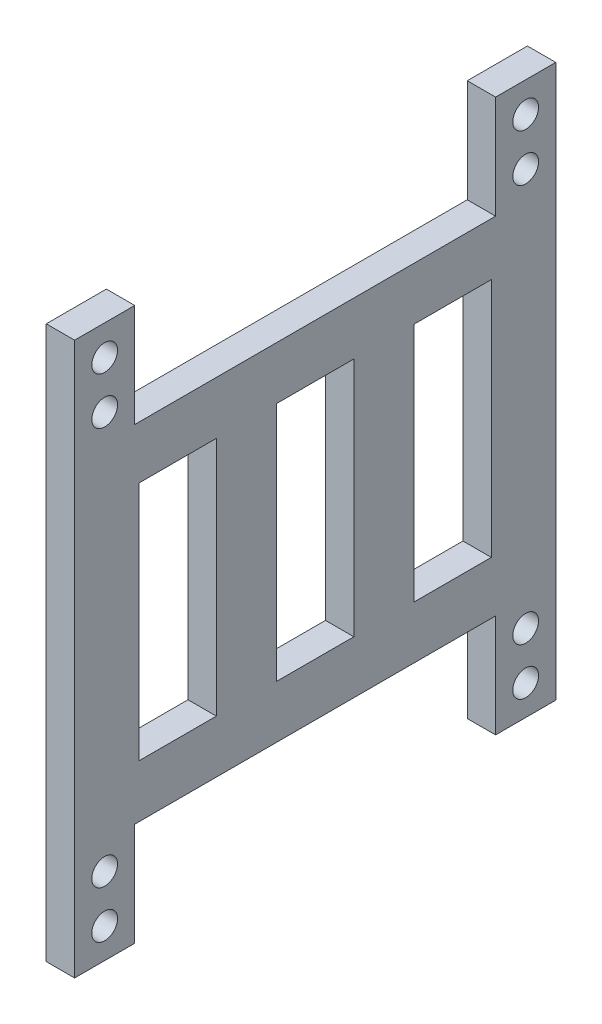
from build123d import *

# Parameters (mm, degrees)
SKETCH2_W           = 7
SKETCH2_H           = 12
SKETCH2_R           = 1.5
BOSS_EXTRUDE1_DEPTH = 3.3
SKETCH3_W           = 9
SKETCH3_H           = 28
CUT_EXTRUDE1_DEPTH  = 10


with BuildPart() as part:
    # Sketch2 → Boss-Extrude1 (new body)
    # profile 1 of 8: a face of its own
    with BuildSketch(Plane(origin=(0, 0, 0), x_dir=(0, 0, -1), z_dir=(1, 0, 0))):
        with Locations((-24.5, 26.145)):
            Rectangle(SKETCH2_W, SKETCH2_H)
        with Locations((-24.5, 23.145)):
            Circle(SKETCH2_R, mode=Mode.SUBTRACT)
        with Locations((-24.5, 28.645)):
            Circle(SKETCH2_R, mode=Mode.SUBTRACT)
    # profile 2 of 8: a face of its own
    with BuildSketch(Plane(origin=(0, 0, 0), x_dir=(0, 0, -1), z_dir=(1, 0, 0))):
        with Locations((24.5, 26.145)):
            Rectangle(SKETCH2_W, SKETCH2_H)
        with Locations((24.5, 23.145)):
            Circle(SKETCH2_R, mode=Mode.SUBTRACT)
        with Locations((24.5, 28.645)):
            Circle(SKETCH2_R, mode=Mode.SUBTRACT)
    # profile 3 of 8: a face of its own
    with BuildSketch(Plane(origin=(0, 0, 0), x_dir=(0, 0, -1), z_dir=(1, 0, 0))):
        with BuildLine():
            Line((0, 3.127738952), (0, 0))
            Line((0, 0), (28, 0))
            Line((28, 0), (28, 20.145))
            Line((28, 20.145), (21, 20.145))
            Line((21, 20.145), (0, 20.145))
            Line((0, 20.145), (0, 4.95658077))
            ThreePointArc((0, 4.95658077), (0.646593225, 4.688753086), (0.914420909, 4.042159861))
            ThreePointArc((0.914420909, 4.042159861), (0.646593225, 3.395566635), (0, 3.127738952))
        make_face()
    # profile 4 of 8: a face of its own
    with BuildSketch(Plane(origin=(0, 0, 0), x_dir=(0, 0, -1), z_dir=(1, 0, 0))):
        with BuildLine():
            Line((-28, 20.145), (-28, 0))
            Line((-28, 0), (0, 0))
            Line((0, 0), (0, 3.127738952))
            ThreePointArc((0, 3.127738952), (-0.914420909, 4.042159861), (0, 4.95658077))
            Line((0, 4.95658077), (0, 20.145))
            Line((0, 20.145), (-21, 20.145))
            Line((-21, 20.145), (-28, 20.145))
        make_face()
    # profile 5 of 8: a face of its own
    with BuildSketch(Plane(origin=(0, 0, 0), x_dir=(0, 0, -1), z_dir=(1, 0, 0))):
        Polygon((0, 0), (-28, 0), (-28, -20.145), (-21, -20.145), (0, -20.145), align=None)
    # profile 6 of 8: a face of its own
    with BuildSketch(Plane(origin=(0, 0, 0), x_dir=(0, 0, -1), z_dir=(1, 0, 0))):
        Polygon((28, 0), (0, 0), (0, -20.145), (21, -20.145), (28, -20.145), align=None)
    # profile 7 of 8: a face of its own
    with BuildSketch(Plane(origin=(0, 0, 0), x_dir=(0, 0, -1), z_dir=(1, 0, 0))):
        with Locations((24.5, -26.145)):
            Rectangle(SKETCH2_W, SKETCH2_H)
        with Locations((24.5, -28.645)):
            Circle(SKETCH2_R, mode=Mode.SUBTRACT)
        with Locations((24.5, -23.145)):
            Circle(SKETCH2_R, mode=Mode.SUBTRACT)
    # profile 8 of 8: a face of its own
    with BuildSketch(Plane(origin=(0, 0, 0), x_dir=(0, 0, -1), z_dir=(1, 0, 0))):
        with Locations((-24.5, -26.145)):
            Rectangle(SKETCH2_W, SKETCH2_H)
        with Locations((-24.5, -28.645)):
            Circle(SKETCH2_R, mode=Mode.SUBTRACT)
        with Locations((-24.5, -23.145)):
            Circle(SKETCH2_R, mode=Mode.SUBTRACT)
    extrude(amount=BOSS_EXTRUDE1_DEPTH)

    # Sketch3 → Cut-Extrude1 (cut)
    with BuildSketch(Plane(origin=(3.3, 0, 0), x_dir=(0, 0, -1), z_dir=(1, 0, 0))):
        Rectangle(SKETCH3_W, SKETCH3_H)
        with Locations((16, 0)):
            Rectangle(SKETCH3_W, SKETCH3_H)
        with Locations((-16, 0)):
            Rectangle(SKETCH3_W, SKETCH3_H)
    extrude(amount=-CUT_EXTRUDE1_DEPTH, mode=Mode.SUBTRACT)


solid = part.part
